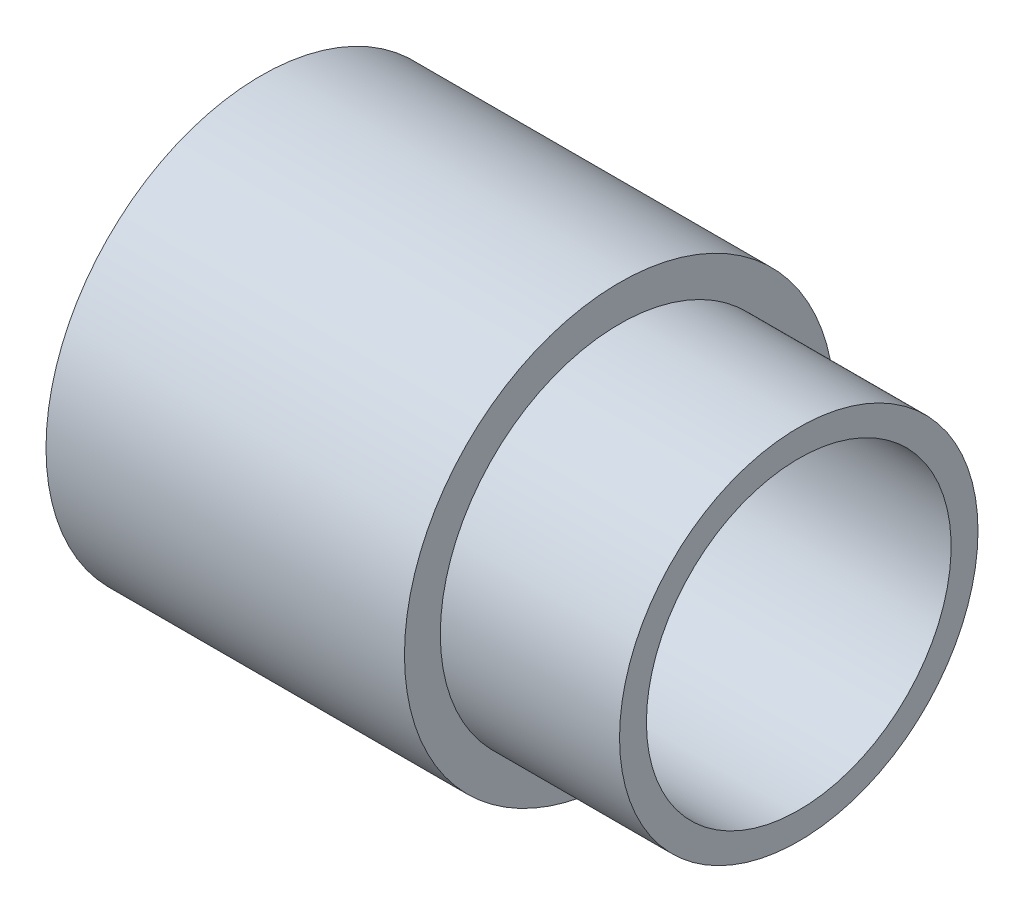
from build123d import *


with BuildPart() as part:
    # Sketch1 → Revolve1 (revolve)
    with BuildSketch(Plane.XY, mode=Mode.PRIVATE) as revolve1_sk:
        Polygon((0, 4.25), (15, 4.25), (15, 5), (10, 5), (10, 6), (0, 6), align=None)
    revolve(revolve1_sk.sketch.rotate(Axis((0, 0, 0), (1, 0, 0)), 90), axis=Axis((0, 0, 0), (1, 0, 0)))


solid = part.part
